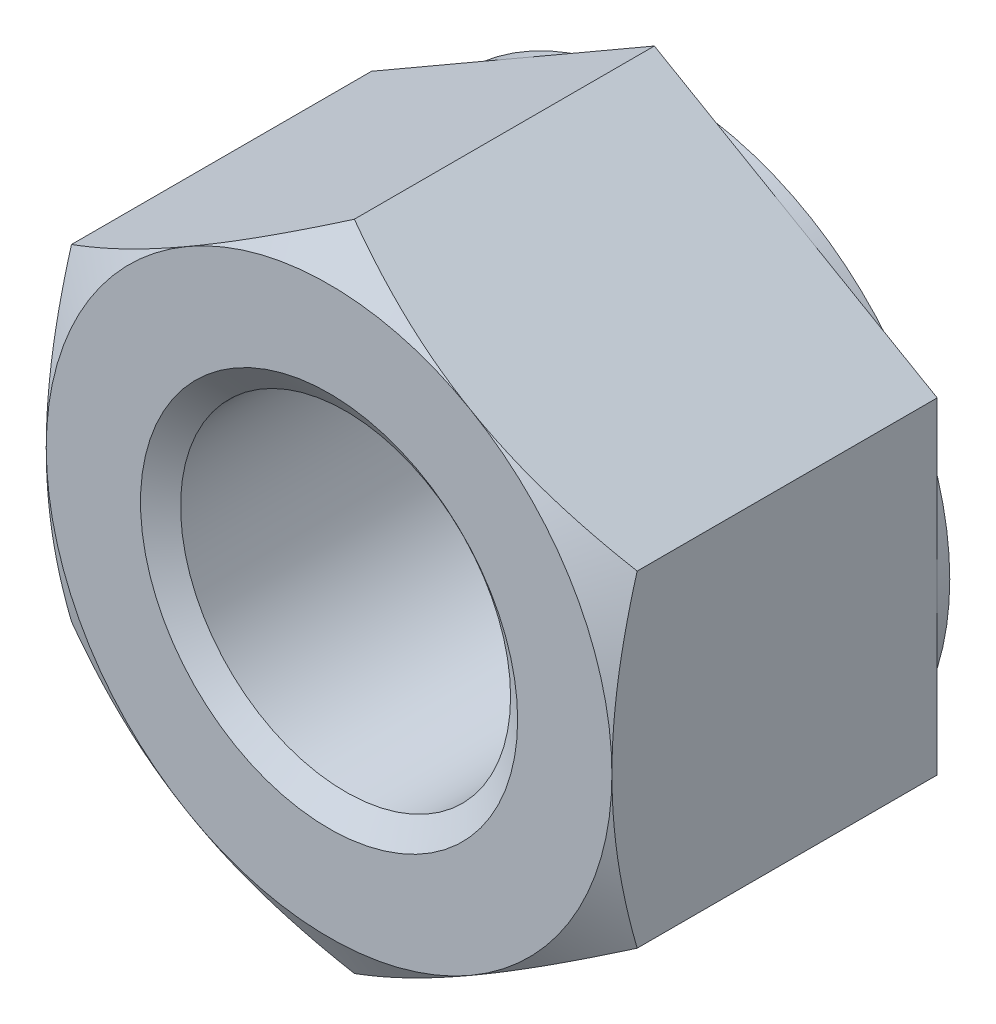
ISO-10303-21;
HEADER;
FILE_DESCRIPTION(('STEP AP214'),'2;1');
FILE_NAME('part.step','',(''),(''),'','','');
FILE_SCHEMA(('AUTOMOTIVE_DESIGN { 1 0 10303 214 1 1 1 1 }'));
ENDSEC;
DATA;
#1=APPLICATION_CONTEXT('core data for automotive mechanical design processes');
#2=APPLICATION_PROTOCOL_DEFINITION('international standard','automotive_design',2000,#1);
#3=PRODUCT_CONTEXT('',#1,'mechanical');
#4=PRODUCT('Part','Part','',(#3));
#5=PRODUCT_RELATED_PRODUCT_CATEGORY('part','',(#4));
#6=PRODUCT_DEFINITION_FORMATION('','',#4);
#7=PRODUCT_DEFINITION_CONTEXT('part definition',#1,'design');
#8=PRODUCT_DEFINITION('design','',#6,#7);
#9=PRODUCT_DEFINITION_SHAPE('','',#8);
#10=(LENGTH_UNIT() NAMED_UNIT(*) SI_UNIT(.MILLI.,.METRE.));
#11=(NAMED_UNIT(*) PLANE_ANGLE_UNIT() SI_UNIT($,.RADIAN.));
#12=(NAMED_UNIT(*) SI_UNIT($,.STERADIAN.) SOLID_ANGLE_UNIT());
#13=UNCERTAINTY_MEASURE_WITH_UNIT(LENGTH_MEASURE(1.E-05),#10,'distance_accuracy_value','');
#14=(GEOMETRIC_REPRESENTATION_CONTEXT(3) GLOBAL_UNCERTAINTY_ASSIGNED_CONTEXT((#13)) GLOBAL_UNIT_ASSIGNED_CONTEXT((#10,
#11,#12)) REPRESENTATION_CONTEXT('',''));
#15=CARTESIAN_POINT('',(0.,0.,0.));
#16=DIRECTION('',(0.,0.,1.));
#17=DIRECTION('',(1.,0.,0.));
#18=AXIS2_PLACEMENT_3D('',#15,#16,#17);
#19=CARTESIAN_POINT('',(0.,0.,-21.5));
#20=DIRECTION('',(0.,0.,1.));
#21=DIRECTION('',(1.,0.,0.));
#22=AXIS2_PLACEMENT_3D('',#19,#20,#21);
#23=CYLINDRICAL_SURFACE('',#22,10.5);
#24=CARTESIAN_POINT('',(0.,0.,-20.4496886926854));
#25=DIRECTION('',(0.,0.,1.));
#26=DIRECTION('',(1.,0.,0.));
#27=AXIS2_PLACEMENT_3D('',#24,#25,#26);
#28=CIRCLE('',#27,10.5);
#29=CARTESIAN_POINT('',(10.5,0.,-20.4496886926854));
#30=VERTEX_POINT('',#29);
#31=EDGE_CURVE('E482',#30,#30,#28,.T.);
#32=ORIENTED_EDGE('',*,*,#31,.F.);
#33=EDGE_LOOP('',(#32));
#34=FACE_BOUND('',#33,.T.);
#35=CARTESIAN_POINT('',(0.,0.,-1.05031130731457));
#36=DIRECTION('',(0.,0.,1.));
#37=DIRECTION('',(1.,0.,0.));
#38=AXIS2_PLACEMENT_3D('',#35,#36,#37);
#39=CIRCLE('',#38,10.5);
#40=CARTESIAN_POINT('',(10.5,0.,-1.05031130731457));
#41=VERTEX_POINT('',#40);
#42=EDGE_CURVE('E481',#41,#41,#39,.T.);
#43=ORIENTED_EDGE('',*,*,#42,.T.);
#44=EDGE_LOOP('',(#43));
#45=FACE_BOUND('',#44,.T.);
#46=ADVANCED_FACE('F33',(#34,#45),#23,.F.);
#47=CARTESIAN_POINT('',(0.,20.7846096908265,-21.5));
#48=DIRECTION('',(-0.500000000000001,0.866025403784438,0.));
#49=DIRECTION('',(-0.866025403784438,-0.500000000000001,0.));
#50=AXIS2_PLACEMENT_3D('',#47,#48,#49);
#51=PLANE('',#50);
#52=DIRECTION('',(0.,0.,1.));
#53=VECTOR('',#52,1.);
#54=CARTESIAN_POINT('',(-18.,10.3923048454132,-21.5));
#55=LINE('',#54,#53);
#56=CARTESIAN_POINT('',(-18.,10.3923048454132,-20.7));
#57=VERTEX_POINT('',#56);
#58=CARTESIAN_POINT('',(-18.,10.3923048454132,-1.60769515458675));
#59=VERTEX_POINT('',#58);
#60=EDGE_CURVE('E280',#57,#59,#55,.T.);
#61=ORIENTED_EDGE('',*,*,#60,.T.);
#62=CARTESIAN_POINT('',(-18.0002,10.3921893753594,-1.60776182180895));
#63=CARTESIAN_POINT('',(-17.6045674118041,10.6206079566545,-1.47589336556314));
#64=CARTESIAN_POINT('',(-17.2073916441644,10.8499174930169,-1.3500088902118));
#65=CARTESIAN_POINT('',(-16.4098552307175,11.310375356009,-1.11187123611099));
#66=CARTESIAN_POINT('',(-16.0094935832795,11.5415242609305,-0.999622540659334));
#67=CARTESIAN_POINT('',(-15.2048116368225,12.0061075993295,-0.790265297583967));
#68=CARTESIAN_POINT('',(-14.8004842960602,12.2395460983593,-0.693192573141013));
#69=CARTESIAN_POINT('',(-13.9890201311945,12.7080451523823,-0.516271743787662));
#70=CARTESIAN_POINT('',(-13.5818834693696,12.9431056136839,-0.43642265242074));
#71=CARTESIAN_POINT('',(-12.7752328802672,13.4088255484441,-0.297345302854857));
#72=CARTESIAN_POINT('',(-12.3757788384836,13.6394504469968,-0.237656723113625));
#73=CARTESIAN_POINT('',(-11.5750403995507,14.1017570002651,-0.137572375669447));
#74=CARTESIAN_POINT('',(-11.1737559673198,14.3334386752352,-0.0971769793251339));
#75=CARTESIAN_POINT('',(-10.370513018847,14.7971912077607,-0.0366989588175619));
#76=CARTESIAN_POINT('',(-9.96855587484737,15.0292612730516,-0.016592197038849));
#77=CARTESIAN_POINT('',(-9.16427056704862,15.4936156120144,0.00287614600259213));
#78=CARTESIAN_POINT('',(-8.76194241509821,15.7258998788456,0.00223836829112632));
#79=CARTESIAN_POINT('',(-8.00978065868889,16.1601606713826,-0.0183335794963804));
#80=CARTESIAN_POINT('',(-7.65989346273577,16.3621681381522,-0.0357591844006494));
#81=CARTESIAN_POINT('',(-6.96095368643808,16.765701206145,-0.0859690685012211));
#82=CARTESIAN_POINT('',(-6.61190109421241,16.9672268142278,-0.118753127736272));
#83=CARTESIAN_POINT('',(-5.91476277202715,17.3697198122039,-0.199111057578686));
#84=CARTESIAN_POINT('',(-5.56667820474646,17.5706865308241,-0.246698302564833));
#85=CARTESIAN_POINT('',(-4.87216610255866,17.9716632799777,-0.355822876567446));
#86=CARTESIAN_POINT('',(-4.5257385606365,18.1716733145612,-0.417360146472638));
#87=CARTESIAN_POINT('',(-3.47411308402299,18.7788295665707,-0.624462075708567));
#88=CARTESIAN_POINT('',(-2.77196054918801,19.1842175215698,-0.790677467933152));
#89=CARTESIAN_POINT('',(-1.37812528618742,19.9889486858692,-1.16791817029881));
#90=CARTESIAN_POINT('',(-0.686424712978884,20.3883021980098,-1.37885488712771));
#91=CARTESIAN_POINT('',(0.000199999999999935,20.7847251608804,-1.60776182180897));
#92=B_SPLINE_CURVE_WITH_KNOTS('',3,(#62,#63,#64,#65,#66,#67,#68,#69,#70,#71,#72,#73,#74,#75,#76,
#77,#78,#79,#80,#81,#82,#83,#84,#85,#86,#87,#88,#89,#90,#91),.UNSPECIFIED.,.F.,.F.,(4,2,2,2,2,2,
2,2,2,2,2,2,2,2,4),(0.,1.42650335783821,2.85347447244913,4.28376471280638,5.71397301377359,
7.10888071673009,8.50381526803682,9.89708828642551,11.2903182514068,12.5031974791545,
13.7160593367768,14.9300201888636,16.1439758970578,18.6253607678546,21.1018751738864),.UNSPECIFIED.);
#93=CARTESIAN_POINT('',(-9.00000000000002,15.5884572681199,0.));
#94=VERTEX_POINT('',#93);
#95=EDGE_CURVE('E134',#59,#94,#92,.T.);
#96=ORIENTED_EDGE('',*,*,#95,.T.);
#97=CARTESIAN_POINT('',(0.,20.7846096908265,-1.60769515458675));
#98=VERTEX_POINT('',#97);
#99=EDGE_CURVE('E161',#94,#98,#92,.T.);
#100=ORIENTED_EDGE('',*,*,#99,.T.);
#101=DIRECTION('',(0.,0.,1.));
#102=VECTOR('',#101,1.);
#103=CARTESIAN_POINT('',(0.,20.7846096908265,-21.5));
#104=LINE('',#103,#102);
#105=CARTESIAN_POINT('',(0.,20.7846096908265,-20.7));
#106=VERTEX_POINT('',#105);
#107=EDGE_CURVE('E268',#106,#98,#104,.T.);
#108=ORIENTED_EDGE('',*,*,#107,.F.);
#109=DIRECTION('',(-0.866025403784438,-0.500000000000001,0.));
#110=VECTOR('',#109,1.);
#111=CARTESIAN_POINT('',(0.,20.7846096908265,-20.7));
#112=LINE('',#111,#110);
#113=CARTESIAN_POINT('',(-9.00000000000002,15.5884572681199,-20.7));
#114=VERTEX_POINT('',#113);
#115=EDGE_CURVE('E256',#106,#114,#112,.T.);
#116=ORIENTED_EDGE('',*,*,#115,.T.);
#117=EDGE_CURVE('E252',#114,#57,#112,.T.);
#118=ORIENTED_EDGE('',*,*,#117,.T.);
#119=EDGE_LOOP('',(#61,#96,#100,#108,#116,#118));
#120=FACE_BOUND('',#119,.T.);
#121=ADVANCED_FACE('F35',(#120),#51,.T.);
#122=CARTESIAN_POINT('',(18.,10.3923048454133,-21.5));
#123=DIRECTION('',(0.500000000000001,0.866025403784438,0.));
#124=DIRECTION('',(-0.866025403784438,0.500000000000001,0.));
#125=AXIS2_PLACEMENT_3D('',#122,#123,#124);
#126=PLANE('',#125);
#127=ORIENTED_EDGE('',*,*,#107,.T.);
#128=CARTESIAN_POINT('',(-0.00020000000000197,20.7847251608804,-1.60776182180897));
#129=CARTESIAN_POINT('',(0.395432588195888,20.5563065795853,-1.47589336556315));
#130=CARTESIAN_POINT('',(0.79260835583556,20.3269970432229,-1.35000889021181));
#131=CARTESIAN_POINT('',(1.59014476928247,19.8665391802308,-1.111871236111));
#132=CARTESIAN_POINT('',(1.99050641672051,19.6353902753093,-0.999622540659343));
#133=CARTESIAN_POINT('',(2.79518836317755,19.1708069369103,-0.790265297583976));
#134=CARTESIAN_POINT('',(3.19951570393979,18.9373684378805,-0.693192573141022));
#135=CARTESIAN_POINT('',(4.01097986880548,18.4688693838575,-0.516271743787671));
#136=CARTESIAN_POINT('',(4.41811653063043,18.2338089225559,-0.436422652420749));
#137=CARTESIAN_POINT('',(5.22476711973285,17.7680889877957,-0.297345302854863));
#138=CARTESIAN_POINT('',(5.62422116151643,17.537464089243,-0.237656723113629));
#139=CARTESIAN_POINT('',(6.4249596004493,17.0751575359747,-0.137572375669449));
#140=CARTESIAN_POINT('',(6.82624403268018,16.8434758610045,-0.0971769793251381));
#141=CARTESIAN_POINT('',(7.62948698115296,16.3797233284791,-0.0366989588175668));
#142=CARTESIAN_POINT('',(8.03144412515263,16.1476532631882,-0.0165921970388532));
#143=CARTESIAN_POINT('',(8.83572943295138,15.6832989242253,0.00287614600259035));
#144=CARTESIAN_POINT('',(9.23805758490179,15.4510146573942,0.00223836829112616));
#145=CARTESIAN_POINT('',(9.99021934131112,15.0167538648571,-0.0183335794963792));
#146=CARTESIAN_POINT('',(10.3401065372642,14.8147463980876,-0.0357591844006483));
#147=CARTESIAN_POINT('',(11.0390463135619,14.4112133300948,-0.0859690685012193));
#148=CARTESIAN_POINT('',(11.3880989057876,14.209687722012,-0.11875312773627));
#149=CARTESIAN_POINT('',(12.0852372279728,13.8071947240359,-0.199111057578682));
#150=CARTESIAN_POINT('',(12.4333217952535,13.6062280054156,-0.246698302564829));
#151=CARTESIAN_POINT('',(13.1278338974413,13.2052512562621,-0.355822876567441));
#152=CARTESIAN_POINT('',(13.4742614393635,13.0052412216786,-0.417360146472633));
#153=CARTESIAN_POINT('',(14.525886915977,12.3980849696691,-0.62446207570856));
#154=CARTESIAN_POINT('',(15.228039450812,11.99269701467,-0.790677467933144));
#155=CARTESIAN_POINT('',(16.6218747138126,11.1879658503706,-1.1679181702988));
#156=CARTESIAN_POINT('',(17.3135752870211,10.78861233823,-1.3788548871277));
#157=CARTESIAN_POINT('',(18.0002,10.3921893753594,-1.60776182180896));
#158=B_SPLINE_CURVE_WITH_KNOTS('',3,(#128,#129,#130,#131,#132,#133,#134,#135,#136,#137,#138,
#139,#140,#141,#142,#143,#144,#145,#146,#147,#148,#149,#150,#151,#152,#153,#154,#155,#156,#157),
.UNSPECIFIED.,.F.,.F.,(4,2,2,2,2,2,2,2,2,2,2,2,2,2,4),(0.,1.42650335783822,2.85347447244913,
4.28376471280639,5.7139730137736,7.1088807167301,8.50381526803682,9.89708828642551,
11.2903182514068,12.5031974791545,13.7160593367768,14.9300201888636,16.1439758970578,
18.6253607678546,21.1018751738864),.UNSPECIFIED.);
#159=CARTESIAN_POINT('',(9.00000000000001,15.5884572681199,0.));
#160=VERTEX_POINT('',#159);
#161=EDGE_CURVE('E157',#98,#160,#158,.T.);
#162=ORIENTED_EDGE('',*,*,#161,.T.);
#163=CARTESIAN_POINT('',(18.,10.3923048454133,-1.60769515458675));
#164=VERTEX_POINT('',#163);
#165=EDGE_CURVE('E143',#160,#164,#158,.T.);
#166=ORIENTED_EDGE('',*,*,#165,.T.);
#167=DIRECTION('',(0.,0.,1.));
#168=VECTOR('',#167,1.);
#169=CARTESIAN_POINT('',(18.,10.3923048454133,-21.5));
#170=LINE('',#169,#168);
#171=CARTESIAN_POINT('',(18.,10.3923048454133,-20.7));
#172=VERTEX_POINT('',#171);
#173=EDGE_CURVE('E156',#172,#164,#170,.T.);
#174=ORIENTED_EDGE('',*,*,#173,.F.);
#175=DIRECTION('',(-0.866025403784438,0.500000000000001,0.));
#176=VECTOR('',#175,1.);
#177=CARTESIAN_POINT('',(18.,10.3923048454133,-20.7));
#178=LINE('',#177,#176);
#179=CARTESIAN_POINT('',(9.00000000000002,15.5884572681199,-20.7));
#180=VERTEX_POINT('',#179);
#181=EDGE_CURVE('E264',#172,#180,#178,.T.);
#182=ORIENTED_EDGE('',*,*,#181,.T.);
#183=EDGE_CURVE('E260',#180,#106,#178,.T.);
#184=ORIENTED_EDGE('',*,*,#183,.T.);
#185=EDGE_LOOP('',(#127,#162,#166,#174,#182,#184));
#186=FACE_BOUND('',#185,.T.);
#187=ADVANCED_FACE('F228',(#186),#126,.T.);
#188=CARTESIAN_POINT('',(18.,10.3923048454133,-21.5));
#189=DIRECTION('',(-1.,0.,0.));
#190=DIRECTION('',(0.,0.,1.));
#191=AXIS2_PLACEMENT_3D('',#188,#189,#190);
#192=PLANE('',#191);
#193=CARTESIAN_POINT('',(18.,-27.5619239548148,-8.61348069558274));
#194=CARTESIAN_POINT('',(18.,-27.1667877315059,-8.4224777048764));
#195=CARTESIAN_POINT('',(18.,-26.7711739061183,-8.23246323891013));
#196=CARTESIAN_POINT('',(18.,-25.978890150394,-7.85463825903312));
#197=CARTESIAN_POINT('',(18.,-25.5822202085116,-7.66682776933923));
#198=CARTESIAN_POINT('',(18.,-24.3903587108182,-7.10698821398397));
#199=CARTESIAN_POINT('',(18.,-23.5934439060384,-6.73861331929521));
#200=CARTESIAN_POINT('',(18.,-21.989547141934,-6.01187832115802));
#201=CARTESIAN_POINT('',(18.,-21.1825336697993,-5.65358759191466));
#202=CARTESIAN_POINT('',(18.,-19.5618746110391,-4.95238944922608));
#203=CARTESIAN_POINT('',(18.,-18.7482293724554,-4.60948123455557));
#204=CARTESIAN_POINT('',(18.,-17.1029123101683,-3.93907746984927));
#205=CARTESIAN_POINT('',(18.,-16.2711418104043,-3.61182282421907));
#206=CARTESIAN_POINT('',(18.,-14.597784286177,-2.98294292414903));
#207=CARTESIAN_POINT('',(18.,-13.7561961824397,-2.68132051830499));
#208=CARTESIAN_POINT('',(18.,-12.0636207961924,-2.11181367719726));
#209=CARTESIAN_POINT('',(18.,-11.2126578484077,-1.84385751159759));
#210=CARTESIAN_POINT('',(18.,-9.4985521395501,-1.3503722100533));
#211=CARTESIAN_POINT('',(18.,-8.63541331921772,-1.12482967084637));
#212=CARTESIAN_POINT('',(18.,-7.33140916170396,-0.826582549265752));
#213=CARTESIAN_POINT('',(18.,-6.89509921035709,-0.733829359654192));
#214=CARTESIAN_POINT('',(18.,-6.01957542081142,-0.563143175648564));
#215=CARTESIAN_POINT('',(18.,-5.5803616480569,-0.485209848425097));
#216=CARTESIAN_POINT('',(18.,-4.69932499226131,-0.345545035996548));
#217=CARTESIAN_POINT('',(18.,-4.25750195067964,-0.283814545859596));
#218=CARTESIAN_POINT('',(18.,-3.37175302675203,-0.177795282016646));
#219=CARTESIAN_POINT('',(18.,-2.92782714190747,-0.133506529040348));
#220=CARTESIAN_POINT('',(18.,-2.04133804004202,-0.0635630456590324));
#221=CARTESIAN_POINT('',(18.,-1.598784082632,-0.0377917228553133));
#222=CARTESIAN_POINT('',(18.,-0.712983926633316,-0.0050185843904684));
#223=CARTESIAN_POINT('',(18.,-0.26973773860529,0.00198351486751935));
#224=CARTESIAN_POINT('',(18.,0.616528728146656,-0.00294785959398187));
#225=CARTESIAN_POINT('',(18.,1.05954903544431,-0.0148760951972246));
#226=CARTESIAN_POINT('',(18.,1.94469673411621,-0.0573715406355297));
#227=CARTESIAN_POINT('',(18.,2.38682408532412,-0.0879395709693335));
#228=CARTESIAN_POINT('',(18.,3.45808110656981,-0.183949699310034));
#229=CARTESIAN_POINT('',(18.,4.08639173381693,-0.258712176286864));
#230=CARTESIAN_POINT('',(18.,5.3380908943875,-0.441718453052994));
#231=CARTESIAN_POINT('',(18.,5.96147868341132,-0.549967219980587));
#232=CARTESIAN_POINT('',(18.,7.82534534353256,-0.919513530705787));
#233=CARTESIAN_POINT('',(18.,9.05709271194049,-1.22536507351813));
#234=CARTESIAN_POINT('',(18.,10.8995809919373,-1.75275444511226));
#235=CARTESIAN_POINT('',(18.,11.5199484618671,-1.94256699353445));
#236=CARTESIAN_POINT('',(18.,12.7546900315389,-2.3411171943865));
#237=CARTESIAN_POINT('',(18.,13.3690635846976,-2.5498565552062));
#238=CARTESIAN_POINT('',(18.,14.5887549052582,-2.98181266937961));
#239=CARTESIAN_POINT('',(18.,15.1941042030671,-3.20494114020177));
#240=CARTESIAN_POINT('',(18.,16.0983156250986,-3.54929436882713));
#241=CARTESIAN_POINT('',(18.,16.3990354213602,-3.66566915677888));
#242=CARTESIAN_POINT('',(18.,16.999306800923,-3.90137756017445));
#243=CARTESIAN_POINT('',(18.,17.2988584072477,-4.02071111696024));
#244=CARTESIAN_POINT('',(18.,17.5978664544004,-4.14139052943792));
#245=B_SPLINE_CURVE_WITH_KNOTS('',3,(#193,#194,#195,#196,#197,#198,#199,#200,#201,#202,#203,
#204,#205,#206,#207,#208,#209,#210,#211,#212,#213,#214,#215,#216,#217,#218,#219,#220,#221,#222,
#223,#224,#225,#226,#227,#228,#229,#230,#231,#232,#233,#234,#235,#236,#237,#238,#239,#240,#241,
#242,#243,#244),.UNSPECIFIED.,.F.,.F.,(4,2,2,2,2,2,2,2,2,2,2,2,2,2,2,2,2,2,2,2,2,2,2,2,2,4),(0.,
1.3166344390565,2.6332833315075,5.2670092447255,7.91580691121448,10.5644664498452,
13.2456434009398,15.9271179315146,18.6027786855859,21.2775924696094,22.6155612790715,
23.9535000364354,25.2915209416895,26.6295434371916,27.9590656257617,29.2885677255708,
30.6177020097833,31.9468948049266,33.8440459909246,35.7414787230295,39.5436531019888,
41.4897689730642,43.436060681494,45.3713764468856,46.338719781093,47.3060439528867),.UNSPECIFIED.);
#246=CARTESIAN_POINT('',(18.,-10.3923048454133,-1.60769515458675));
#247=VERTEX_POINT('',#246);
#248=CARTESIAN_POINT('',(18.,0.,0.));
#249=VERTEX_POINT('',#248);
#250=EDGE_CURVE('E123',#247,#249,#245,.T.);
#251=ORIENTED_EDGE('',*,*,#250,.F.);
#252=DIRECTION('',(0.,0.,1.));
#253=VECTOR('',#252,1.);
#254=CARTESIAN_POINT('',(18.,-10.3923048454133,-21.5));
#255=LINE('',#254,#253);
#256=CARTESIAN_POINT('',(18.,-10.3923048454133,-20.7));
#257=VERTEX_POINT('',#256);
#258=EDGE_CURVE('E273',#257,#247,#255,.T.);
#259=ORIENTED_EDGE('',*,*,#258,.F.);
#260=DIRECTION('',(0.,-1.,0.));
#261=VECTOR('',#260,1.);
#262=CARTESIAN_POINT('',(18.,10.3923048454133,-20.7));
#263=LINE('',#262,#261);
#264=CARTESIAN_POINT('',(18.,0.,-20.7));
#265=VERTEX_POINT('',#264);
#266=EDGE_CURVE('E265',#265,#257,#263,.T.);
#267=ORIENTED_EDGE('',*,*,#266,.F.);
#268=EDGE_CURVE('E267',#172,#265,#263,.T.);
#269=ORIENTED_EDGE('',*,*,#268,.F.);
#270=ORIENTED_EDGE('',*,*,#173,.T.);
#271=EDGE_CURVE('E136',#249,#164,#245,.T.);
#272=ORIENTED_EDGE('',*,*,#271,.F.);
#273=EDGE_LOOP('',(#251,#259,#267,#269,#270,#272));
#274=FACE_BOUND('',#273,.T.);
#275=ADVANCED_FACE('F153',(#274),#192,.F.);
#276=CARTESIAN_POINT('',(0.,-20.7846096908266,-21.5));
#277=DIRECTION('',(0.500000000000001,-0.866025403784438,0.));
#278=DIRECTION('',(0.866025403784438,0.500000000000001,0.));
#279=AXIS2_PLACEMENT_3D('',#276,#277,#278);
#280=PLANE('',#279);
#281=ORIENTED_EDGE('',*,*,#258,.T.);
#282=CARTESIAN_POINT('',(18.0002,-10.3921893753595,-1.60776182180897));
#283=CARTESIAN_POINT('',(17.6045674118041,-10.6206079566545,-1.47589336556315));
#284=CARTESIAN_POINT('',(17.2073916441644,-10.8499174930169,-1.35000889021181));
#285=CARTESIAN_POINT('',(16.4098552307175,-11.310375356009,-1.111871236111));
#286=CARTESIAN_POINT('',(16.0094935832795,-11.5415242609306,-0.999622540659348));
#287=CARTESIAN_POINT('',(15.2048116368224,-12.0061075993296,-0.790265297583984));
#288=CARTESIAN_POINT('',(14.8004842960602,-12.2395460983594,-0.693192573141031));
#289=CARTESIAN_POINT('',(13.9890201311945,-12.7080451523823,-0.516271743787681));
#290=CARTESIAN_POINT('',(13.5818834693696,-12.9431056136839,-0.436422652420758));
#291=CARTESIAN_POINT('',(12.7752328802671,-13.4088255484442,-0.297345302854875));
#292=CARTESIAN_POINT('',(12.3757788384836,-13.6394504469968,-0.237656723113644));
#293=CARTESIAN_POINT('',(11.5750403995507,-14.1017570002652,-0.137572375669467));
#294=CARTESIAN_POINT('',(11.1737559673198,-14.3334386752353,-0.0971769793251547));
#295=CARTESIAN_POINT('',(10.370513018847,-14.7971912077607,-0.0366989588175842));
#296=CARTESIAN_POINT('',(9.96855587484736,-15.0292612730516,-0.0165921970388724));
#297=CARTESIAN_POINT('',(9.16427056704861,-15.4936156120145,0.00287614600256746));
#298=CARTESIAN_POINT('',(8.7619424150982,-15.7258998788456,0.00223836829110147));
#299=CARTESIAN_POINT('',(8.00978065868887,-16.1601606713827,-0.0183335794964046));
#300=CARTESIAN_POINT('',(7.65989346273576,-16.3621681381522,-0.035759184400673));
#301=CARTESIAN_POINT('',(6.96095368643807,-16.765701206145,-0.085969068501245));
#302=CARTESIAN_POINT('',(6.6119010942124,-16.9672268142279,-0.118753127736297));
#303=CARTESIAN_POINT('',(5.91476277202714,-17.3697198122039,-0.199111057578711));
#304=CARTESIAN_POINT('',(5.56667820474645,-17.5706865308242,-0.246698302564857));
#305=CARTESIAN_POINT('',(4.87216610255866,-17.9716632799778,-0.355822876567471));
#306=CARTESIAN_POINT('',(4.5257385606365,-18.1716733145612,-0.417360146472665));
#307=CARTESIAN_POINT('',(3.47411308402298,-18.7788295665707,-0.624462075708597));
#308=CARTESIAN_POINT('',(2.77196054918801,-19.1842175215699,-0.790677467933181));
#309=CARTESIAN_POINT('',(1.37812528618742,-19.9889486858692,-1.16791817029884));
#310=CARTESIAN_POINT('',(0.686424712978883,-20.3883021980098,-1.37885488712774));
#311=CARTESIAN_POINT('',(-0.000199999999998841,-20.7847251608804,-1.607761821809));
#312=B_SPLINE_CURVE_WITH_KNOTS('',3,(#282,#283,#284,#285,#286,#287,#288,#289,#290,#291,#292,
#293,#294,#295,#296,#297,#298,#299,#300,#301,#302,#303,#304,#305,#306,#307,#308,#309,#310,#311),
.UNSPECIFIED.,.F.,.F.,(4,2,2,2,2,2,2,2,2,2,2,2,2,2,4),(0.,1.42650335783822,2.85347447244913,
4.28376471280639,5.7139730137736,7.1088807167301,8.50381526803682,9.89708828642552,
11.2903182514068,12.5031974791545,13.7160593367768,14.9300201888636,16.1439758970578,
18.6253607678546,21.1018751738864),.UNSPECIFIED.);
#313=CARTESIAN_POINT('',(9.00000000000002,-15.5884572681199,0.));
#314=VERTEX_POINT('',#313);
#315=EDGE_CURVE('E129',#247,#314,#312,.T.);
#316=ORIENTED_EDGE('',*,*,#315,.T.);
#317=CARTESIAN_POINT('',(0.,-20.7846096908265,-1.60769515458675));
#318=VERTEX_POINT('',#317);
#319=EDGE_CURVE('E50',#314,#318,#312,.T.);
#320=ORIENTED_EDGE('',*,*,#319,.T.);
#321=DIRECTION('',(0.,0.,1.));
#322=VECTOR('',#321,1.);
#323=CARTESIAN_POINT('',(0.,-20.7846096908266,-21.5));
#324=LINE('',#323,#322);
#325=CARTESIAN_POINT('',(0.,-20.7846096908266,-20.7));
#326=VERTEX_POINT('',#325);
#327=EDGE_CURVE('E275',#326,#318,#324,.T.);
#328=ORIENTED_EDGE('',*,*,#327,.F.);
#329=DIRECTION('',(0.866025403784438,0.500000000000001,0.));
#330=VECTOR('',#329,1.);
#331=CARTESIAN_POINT('',(0.,-20.7846096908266,-20.7));
#332=LINE('',#331,#330);
#333=CARTESIAN_POINT('',(9.00000000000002,-15.5884572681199,-20.7));
#334=VERTEX_POINT('',#333);
#335=EDGE_CURVE('E257',#326,#334,#332,.T.);
#336=ORIENTED_EDGE('',*,*,#335,.T.);
#337=EDGE_CURVE('E261',#334,#257,#332,.T.);
#338=ORIENTED_EDGE('',*,*,#337,.T.);
#339=EDGE_LOOP('',(#281,#316,#320,#328,#336,#338));
#340=FACE_BOUND('',#339,.T.);
#341=ADVANCED_FACE('F209',(#340),#280,.T.);
#342=CARTESIAN_POINT('',(-18.,-10.3923048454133,-21.5));
#343=DIRECTION('',(-0.500000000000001,-0.866025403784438,0.));
#344=DIRECTION('',(0.866025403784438,-0.500000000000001,0.));
#345=AXIS2_PLACEMENT_3D('',#342,#343,#344);
#346=PLANE('',#345);
#347=ORIENTED_EDGE('',*,*,#327,.T.);
#348=CARTESIAN_POINT('',(0.000200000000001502,-20.7847251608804,-1.607761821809));
#349=CARTESIAN_POINT('',(-0.395432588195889,-20.5563065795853,-1.47589336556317));
#350=CARTESIAN_POINT('',(-0.792608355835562,-20.326997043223,-1.35000889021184));
#351=CARTESIAN_POINT('',(-1.59014476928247,-19.8665391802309,-1.11187123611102));
#352=CARTESIAN_POINT('',(-1.99050641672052,-19.6353902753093,-0.999622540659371));
#353=CARTESIAN_POINT('',(-2.79518836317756,-19.1708069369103,-0.790265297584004));
#354=CARTESIAN_POINT('',(-3.1995157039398,-18.9373684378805,-0.69319257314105));
#355=CARTESIAN_POINT('',(-4.01097986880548,-18.4688693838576,-0.516271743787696));
#356=CARTESIAN_POINT('',(-4.41811653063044,-18.233808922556,-0.436422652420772));
#357=CARTESIAN_POINT('',(-5.22476711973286,-17.7680889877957,-0.297345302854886));
#358=CARTESIAN_POINT('',(-5.62422116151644,-17.5374640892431,-0.237656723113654));
#359=CARTESIAN_POINT('',(-6.42495960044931,-17.0751575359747,-0.137572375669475));
#360=CARTESIAN_POINT('',(-6.8262440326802,-16.8434758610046,-0.0971769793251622));
#361=CARTESIAN_POINT('',(-7.62948698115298,-16.3797233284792,-0.0366989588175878));
#362=CARTESIAN_POINT('',(-8.03144412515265,-16.1476532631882,-0.0165921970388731));
#363=CARTESIAN_POINT('',(-8.8357294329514,-15.6832989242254,0.00287614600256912));
#364=CARTESIAN_POINT('',(-9.23805758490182,-15.4510146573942,0.00223836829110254));
#365=CARTESIAN_POINT('',(-9.99021934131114,-15.0167538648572,-0.0183335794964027));
#366=CARTESIAN_POINT('',(-10.3401065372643,-14.8147463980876,-0.0357591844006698));
#367=CARTESIAN_POINT('',(-11.0390463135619,-14.4112133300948,-0.0859690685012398));
#368=CARTESIAN_POINT('',(-11.3880989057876,-14.209687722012,-0.118753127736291));
#369=CARTESIAN_POINT('',(-12.0852372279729,-13.8071947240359,-0.199111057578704));
#370=CARTESIAN_POINT('',(-12.4333217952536,-13.6062280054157,-0.24669830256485));
#371=CARTESIAN_POINT('',(-13.1278338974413,-13.2052512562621,-0.355822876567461));
#372=CARTESIAN_POINT('',(-13.4742614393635,-13.0052412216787,-0.417360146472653));
#373=CARTESIAN_POINT('',(-14.525886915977,-12.3980849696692,-0.62446207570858));
#374=CARTESIAN_POINT('',(-15.228039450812,-11.99269701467,-0.790677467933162));
#375=CARTESIAN_POINT('',(-16.6218747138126,-11.1879658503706,-1.16791817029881));
#376=CARTESIAN_POINT('',(-17.3135752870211,-10.7886123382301,-1.37885488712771));
#377=CARTESIAN_POINT('',(-18.0002,-10.3921893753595,-1.60776182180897));
#378=B_SPLINE_CURVE_WITH_KNOTS('',3,(#348,#349,#350,#351,#352,#353,#354,#355,#356,#357,#358,
#359,#360,#361,#362,#363,#364,#365,#366,#367,#368,#369,#370,#371,#372,#373,#374,#375,#376,#377),
.UNSPECIFIED.,.F.,.F.,(4,2,2,2,2,2,2,2,2,2,2,2,2,2,4),(0.,1.42650335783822,2.85347447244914,
4.2837647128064,5.71397301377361,7.10888071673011,8.50381526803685,9.89708828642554,
11.2903182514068,12.5031974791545,13.7160593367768,14.9300201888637,16.1439758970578,
18.6253607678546,21.1018751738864),.UNSPECIFIED.);
#379=CARTESIAN_POINT('',(-9.00000000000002,-15.5884572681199,0.));
#380=VERTEX_POINT('',#379);
#381=EDGE_CURVE('E203',#318,#380,#378,.T.);
#382=ORIENTED_EDGE('',*,*,#381,.T.);
#383=CARTESIAN_POINT('',(-18.,-10.3923048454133,-1.60769515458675));
#384=VERTEX_POINT('',#383);
#385=EDGE_CURVE('E57',#380,#384,#378,.T.);
#386=ORIENTED_EDGE('',*,*,#385,.T.);
#387=DIRECTION('',(0.,0.,1.));
#388=VECTOR('',#387,1.);
#389=CARTESIAN_POINT('',(-18.,-10.3923048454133,-21.5));
#390=LINE('',#389,#388);
#391=CARTESIAN_POINT('',(-18.,-10.3923048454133,-20.7));
#392=VERTEX_POINT('',#391);
#393=EDGE_CURVE('E278',#392,#384,#390,.T.);
#394=ORIENTED_EDGE('',*,*,#393,.F.);
#395=DIRECTION('',(0.866025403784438,-0.500000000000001,0.));
#396=VECTOR('',#395,1.);
#397=CARTESIAN_POINT('',(-18.,-10.3923048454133,-20.7));
#398=LINE('',#397,#396);
#399=CARTESIAN_POINT('',(-9.00000000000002,-15.5884572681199,-20.7));
#400=VERTEX_POINT('',#399);
#401=EDGE_CURVE('E247',#392,#400,#398,.T.);
#402=ORIENTED_EDGE('',*,*,#401,.T.);
#403=EDGE_CURVE('E253',#400,#326,#398,.T.);
#404=ORIENTED_EDGE('',*,*,#403,.T.);
#405=EDGE_LOOP('',(#347,#382,#386,#394,#402,#404));
#406=FACE_BOUND('',#405,.T.);
#407=ADVANCED_FACE('F205',(#406),#346,.T.);
#408=CARTESIAN_POINT('',(-18.,10.3923048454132,-21.5));
#409=DIRECTION('',(-1.,0.,0.));
#410=DIRECTION('',(0.,0.,1.));
#411=AXIS2_PLACEMENT_3D('',#408,#409,#410);
#412=PLANE('',#411);
#413=ORIENTED_EDGE('',*,*,#393,.T.);
#414=CARTESIAN_POINT('',(-18.,-27.5619239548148,-8.61348069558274));
#415=CARTESIAN_POINT('',(-18.,-27.1667877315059,-8.42247770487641));
#416=CARTESIAN_POINT('',(-18.,-26.7711739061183,-8.23246323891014));
#417=CARTESIAN_POINT('',(-18.,-25.978890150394,-7.85463825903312));
#418=CARTESIAN_POINT('',(-18.,-25.5822202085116,-7.66682776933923));
#419=CARTESIAN_POINT('',(-18.,-24.3903587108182,-7.10698821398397));
#420=CARTESIAN_POINT('',(-18.,-23.5934439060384,-6.73861331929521));
#421=CARTESIAN_POINT('',(-18.,-21.989547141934,-6.01187832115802));
#422=CARTESIAN_POINT('',(-18.,-21.1825336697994,-5.65358759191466));
#423=CARTESIAN_POINT('',(-18.,-19.5618746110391,-4.95238944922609));
#424=CARTESIAN_POINT('',(-18.,-18.7482293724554,-4.60948123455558));
#425=CARTESIAN_POINT('',(-18.,-17.1029123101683,-3.93907746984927));
#426=CARTESIAN_POINT('',(-18.,-16.2711418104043,-3.61182282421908));
#427=CARTESIAN_POINT('',(-18.,-14.597784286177,-2.98294292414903));
#428=CARTESIAN_POINT('',(-18.,-13.7561961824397,-2.68132051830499));
#429=CARTESIAN_POINT('',(-18.,-12.0636207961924,-2.11181367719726));
#430=CARTESIAN_POINT('',(-18.,-11.2126578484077,-1.8438575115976));
#431=CARTESIAN_POINT('',(-18.,-9.49855213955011,-1.3503722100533));
#432=CARTESIAN_POINT('',(-18.,-8.63541331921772,-1.12482967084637));
#433=CARTESIAN_POINT('',(-18.,-7.33140916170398,-0.826582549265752));
#434=CARTESIAN_POINT('',(-18.,-6.8950992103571,-0.733829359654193));
#435=CARTESIAN_POINT('',(-18.,-6.01957542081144,-0.563143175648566));
#436=CARTESIAN_POINT('',(-18.,-5.58036164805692,-0.4852098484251));
#437=CARTESIAN_POINT('',(-18.,-4.69932499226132,-0.345545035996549));
#438=CARTESIAN_POINT('',(-18.,-4.25750195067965,-0.283814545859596));
#439=CARTESIAN_POINT('',(-18.,-3.37175302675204,-0.177795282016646));
#440=CARTESIAN_POINT('',(-18.,-2.92782714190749,-0.133506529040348));
#441=CARTESIAN_POINT('',(-18.,-2.04133804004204,-0.0635630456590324));
#442=CARTESIAN_POINT('',(-18.,-1.59878408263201,-0.0377917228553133));
#443=CARTESIAN_POINT('',(-18.,-0.71298392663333,-0.00501858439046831));
#444=CARTESIAN_POINT('',(-18.,-0.269737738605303,0.0019835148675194));
#445=CARTESIAN_POINT('',(-18.,0.616528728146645,-0.00294785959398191));
#446=CARTESIAN_POINT('',(-18.,1.0595490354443,-0.0148760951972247));
#447=CARTESIAN_POINT('',(-18.,1.9446967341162,-0.0573715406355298));
#448=CARTESIAN_POINT('',(-18.,2.38682408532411,-0.0879395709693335));
#449=CARTESIAN_POINT('',(-18.,3.45808110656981,-0.183949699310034));
#450=CARTESIAN_POINT('',(-18.,4.08639173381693,-0.258712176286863));
#451=CARTESIAN_POINT('',(-18.,5.3380908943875,-0.441718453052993));
#452=CARTESIAN_POINT('',(-18.,5.96147868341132,-0.549967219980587));
#453=CARTESIAN_POINT('',(-18.,7.82534534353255,-0.919513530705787));
#454=CARTESIAN_POINT('',(-18.,9.05709271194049,-1.22536507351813));
#455=CARTESIAN_POINT('',(-18.,10.8995809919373,-1.75275444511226));
#456=CARTESIAN_POINT('',(-18.,11.5199484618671,-1.94256699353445));
#457=CARTESIAN_POINT('',(-18.,12.7546900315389,-2.3411171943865));
#458=CARTESIAN_POINT('',(-18.,13.3690635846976,-2.5498565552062));
#459=CARTESIAN_POINT('',(-18.,14.5887549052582,-2.98181266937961));
#460=CARTESIAN_POINT('',(-18.,15.1941042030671,-3.20494114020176));
#461=CARTESIAN_POINT('',(-18.,16.0983156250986,-3.54929436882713));
#462=CARTESIAN_POINT('',(-18.,16.3990354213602,-3.66566915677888));
#463=CARTESIAN_POINT('',(-18.,16.999306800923,-3.90137756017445));
#464=CARTESIAN_POINT('',(-18.,17.2988584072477,-4.02071111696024));
#465=CARTESIAN_POINT('',(-18.,17.5978664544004,-4.14139052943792));
#466=B_SPLINE_CURVE_WITH_KNOTS('',3,(#414,#415,#416,#417,#418,#419,#420,#421,#422,#423,#424,
#425,#426,#427,#428,#429,#430,#431,#432,#433,#434,#435,#436,#437,#438,#439,#440,#441,#442,#443,
#444,#445,#446,#447,#448,#449,#450,#451,#452,#453,#454,#455,#456,#457,#458,#459,#460,#461,#462,
#463,#464,#465),.UNSPECIFIED.,.F.,.F.,(4,2,2,2,2,2,2,2,2,2,2,2,2,2,2,2,2,2,2,2,2,2,2,2,2,4),(0.,
1.3166344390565,2.6332833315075,5.2670092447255,7.91580691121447,10.5644664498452,
13.2456434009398,15.9271179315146,18.6027786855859,21.2775924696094,22.6155612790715,
23.9535000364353,25.2915209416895,26.6295434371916,27.9590656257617,29.2885677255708,
30.6177020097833,31.9468948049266,33.8440459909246,35.7414787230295,39.5436531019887,
41.4897689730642,43.436060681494,45.3713764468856,46.338719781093,47.3060439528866),.UNSPECIFIED.);
#467=CARTESIAN_POINT('',(-18.,0.,0.));
#468=VERTEX_POINT('',#467);
#469=EDGE_CURVE('E204',#384,#468,#466,.T.);
#470=ORIENTED_EDGE('',*,*,#469,.T.);
#471=EDGE_CURVE('E147',#468,#59,#466,.T.);
#472=ORIENTED_EDGE('',*,*,#471,.T.);
#473=ORIENTED_EDGE('',*,*,#60,.F.);
#474=DIRECTION('',(0.,-1.,0.));
#475=VECTOR('',#474,1.);
#476=CARTESIAN_POINT('',(-18.,10.3923048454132,-20.7));
#477=LINE('',#476,#475);
#478=CARTESIAN_POINT('',(-18.,0.,-20.7));
#479=VERTEX_POINT('',#478);
#480=EDGE_CURVE('E286',#57,#479,#477,.T.);
#481=ORIENTED_EDGE('',*,*,#480,.T.);
#482=EDGE_CURVE('E284',#479,#392,#477,.T.);
#483=ORIENTED_EDGE('',*,*,#482,.T.);
#484=EDGE_LOOP('',(#413,#470,#472,#473,#481,#483));
#485=FACE_BOUND('',#484,.T.);
#486=ADVANCED_FACE('F208',(#485),#412,.T.);
#487=CARTESIAN_POINT('',(-36.,0.,0.));
#488=DIRECTION('',(0.,0.,1.));
#489=DIRECTION('',(1.,0.,0.));
#490=AXIS2_PLACEMENT_3D('',#487,#488,#489);
#491=PLANE('',#490);
#492=CARTESIAN_POINT('',(0.,0.,0.));
#493=DIRECTION('',(0.,0.,1.));
#494=DIRECTION('',(1.,0.,0.));
#495=AXIS2_PLACEMENT_3D('',#492,#493,#494);
#496=CIRCLE('',#495,12.);
#497=CARTESIAN_POINT('',(12.,0.,0.));
#498=VERTEX_POINT('',#497);
#499=EDGE_CURVE('E478',#498,#498,#496,.T.);
#500=ORIENTED_EDGE('',*,*,#499,.F.);
#501=EDGE_LOOP('',(#500));
#502=FACE_BOUND('',#501,.T.);
#503=CARTESIAN_POINT('',(0.,0.,0.));
#504=DIRECTION('',(0.,0.,1.));
#505=DIRECTION('',(1.,0.,0.));
#506=AXIS2_PLACEMENT_3D('',#503,#504,#505);
#507=CIRCLE('',#506,18.);
#508=EDGE_CURVE('E12',#249,#314,#507,.F.);
#509=ORIENTED_EDGE('',*,*,#508,.F.);
#510=CARTESIAN_POINT('',(0.,0.,0.));
#511=DIRECTION('',(0.,0.,1.));
#512=DIRECTION('',(1.,0.,0.));
#513=AXIS2_PLACEMENT_3D('',#510,#511,#512);
#514=CIRCLE('',#513,18.);
#515=EDGE_CURVE('E140',#249,#160,#514,.T.);
#516=ORIENTED_EDGE('',*,*,#515,.T.);
#517=EDGE_CURVE('E43',#94,#160,#507,.F.);
#518=ORIENTED_EDGE('',*,*,#517,.F.);
#519=EDGE_CURVE('E290',#468,#94,#507,.F.);
#520=ORIENTED_EDGE('',*,*,#519,.F.);
#521=EDGE_CURVE('E293',#380,#468,#507,.F.);
#522=ORIENTED_EDGE('',*,*,#521,.F.);
#523=EDGE_CURVE('E42',#314,#380,#507,.F.);
#524=ORIENTED_EDGE('',*,*,#523,.F.);
#525=EDGE_LOOP('',(#509,#516,#518,#520,#522,#524));
#526=FACE_BOUND('',#525,.T.);
#527=ADVANCED_FACE('F150',(#502,#526),#491,.T.);
#528=CARTESIAN_POINT('',(-36.,0.,-21.5));
#529=DIRECTION('',(0.,0.,1.));
#530=DIRECTION('',(1.,0.,0.));
#531=AXIS2_PLACEMENT_3D('',#528,#529,#530);
#532=PLANE('',#531);
#533=CARTESIAN_POINT('',(0.,0.,-21.5));
#534=DIRECTION('',(0.,0.,1.));
#535=DIRECTION('',(1.,0.,0.));
#536=AXIS2_PLACEMENT_3D('',#533,#534,#535);
#537=CIRCLE('',#536,12.);
#538=CARTESIAN_POINT('',(12.,0.,-21.5));
#539=VERTEX_POINT('',#538);
#540=EDGE_CURVE('E148',#539,#539,#537,.T.);
#541=ORIENTED_EDGE('',*,*,#540,.T.);
#542=EDGE_LOOP('',(#541));
#543=FACE_BOUND('',#542,.T.);
#544=CARTESIAN_POINT('',(0.,0.,-21.5));
#545=DIRECTION('',(0.,0.,1.));
#546=DIRECTION('',(1.,0.,0.));
#547=AXIS2_PLACEMENT_3D('',#544,#545,#546);
#548=CIRCLE('',#547,18.);
#549=CARTESIAN_POINT('',(18.,0.,-21.5));
#550=VERTEX_POINT('',#549);
#551=EDGE_CURVE('E271',#550,#550,#548,.F.);
#552=ORIENTED_EDGE('',*,*,#551,.T.);
#553=EDGE_LOOP('',(#552));
#554=FACE_BOUND('',#553,.T.);
#555=ADVANCED_FACE('F218',(#543,#554),#532,.F.);
#556=CARTESIAN_POINT('',(0.,30.7846096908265,-20.7));
#557=DIRECTION('',(0.,0.,-1.));
#558=DIRECTION('',(-1.,0.,0.));
#559=AXIS2_PLACEMENT_3D('',#556,#557,#558);
#560=PLANE('',#559);
#561=ORIENTED_EDGE('',*,*,#268,.T.);
#562=CARTESIAN_POINT('',(0.,0.,-20.7));
#563=DIRECTION('',(0.,0.,1.));
#564=DIRECTION('',(1.,0.,0.));
#565=AXIS2_PLACEMENT_3D('',#562,#563,#564);
#566=CIRCLE('',#565,18.);
#567=EDGE_CURVE('E244',#265,#180,#566,.T.);
#568=ORIENTED_EDGE('',*,*,#567,.T.);
#569=ORIENTED_EDGE('',*,*,#181,.F.);
#570=EDGE_LOOP('',(#561,#568,#569));
#571=FACE_BOUND('',#570,.T.);
#572=ADVANCED_FACE('F235',(#571),#560,.T.);
#573=ORIENTED_EDGE('',*,*,#266,.T.);
#574=ORIENTED_EDGE('',*,*,#337,.F.);
#575=EDGE_CURVE('E249',#334,#265,#566,.T.);
#576=ORIENTED_EDGE('',*,*,#575,.T.);
#577=EDGE_LOOP('',(#573,#574,#576));
#578=FACE_BOUND('',#577,.T.);
#579=ADVANCED_FACE('F305',(#578),#560,.T.);
#580=EDGE_CURVE('E248',#180,#114,#566,.T.);
#581=ORIENTED_EDGE('',*,*,#580,.T.);
#582=ORIENTED_EDGE('',*,*,#115,.F.);
#583=ORIENTED_EDGE('',*,*,#183,.F.);
#584=EDGE_LOOP('',(#581,#582,#583));
#585=FACE_BOUND('',#584,.T.);
#586=ADVANCED_FACE('F387',(#585),#560,.T.);
#587=ORIENTED_EDGE('',*,*,#403,.F.);
#588=EDGE_CURVE('E311',#400,#334,#566,.T.);
#589=ORIENTED_EDGE('',*,*,#588,.T.);
#590=ORIENTED_EDGE('',*,*,#335,.F.);
#591=EDGE_LOOP('',(#587,#589,#590));
#592=FACE_BOUND('',#591,.T.);
#593=ADVANCED_FACE('F378',(#592),#560,.T.);
#594=EDGE_CURVE('E505',#114,#479,#566,.T.);
#595=ORIENTED_EDGE('',*,*,#594,.T.);
#596=ORIENTED_EDGE('',*,*,#480,.F.);
#597=ORIENTED_EDGE('',*,*,#117,.F.);
#598=EDGE_LOOP('',(#595,#596,#597));
#599=FACE_BOUND('',#598,.T.);
#600=ADVANCED_FACE('F329',(#599),#560,.T.);
#601=CARTESIAN_POINT('',(0.,0.,0.));
#602=DIRECTION('',(0.,0.,1.));
#603=DIRECTION('',(1.,0.,0.));
#604=AXIS2_PLACEMENT_3D('',#601,#602,#603);
#605=CYLINDRICAL_SURFACE('',#604,18.);
#606=ORIENTED_EDGE('',*,*,#551,.F.);
#607=EDGE_LOOP('',(#606));
#608=FACE_BOUND('',#607,.T.);
#609=ORIENTED_EDGE('',*,*,#580,.F.);
#610=ORIENTED_EDGE('',*,*,#567,.F.);
#611=ORIENTED_EDGE('',*,*,#575,.F.);
#612=ORIENTED_EDGE('',*,*,#588,.F.);
#613=EDGE_CURVE('E508',#479,#400,#566,.T.);
#614=ORIENTED_EDGE('',*,*,#613,.F.);
#615=ORIENTED_EDGE('',*,*,#594,.F.);
#616=EDGE_LOOP('',(#609,#610,#611,#612,#614,#615));
#617=FACE_BOUND('',#616,.T.);
#618=ADVANCED_FACE('F188',(#608,#617),#605,.T.);
#619=ORIENTED_EDGE('',*,*,#482,.F.);
#620=ORIENTED_EDGE('',*,*,#613,.T.);
#621=ORIENTED_EDGE('',*,*,#401,.F.);
#622=EDGE_LOOP('',(#619,#620,#621));
#623=FACE_BOUND('',#622,.T.);
#624=ADVANCED_FACE('F233',(#623),#560,.T.);
#625=CARTESIAN_POINT('',(0.,0.,0.));
#626=DIRECTION('',(0.,0.,-1.));
#627=DIRECTION('',(-1.,0.,0.));
#628=AXIS2_PLACEMENT_3D('',#625,#626,#627);
#629=CONICAL_SURFACE('',#628,18.,1.0471975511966);
#630=ORIENTED_EDGE('',*,*,#515,.F.);
#631=ORIENTED_EDGE('',*,*,#271,.T.);
#632=ORIENTED_EDGE('',*,*,#165,.F.);
#633=EDGE_LOOP('',(#630,#631,#632));
#634=FACE_BOUND('',#633,.T.);
#635=ADVANCED_FACE('F141',(#634),#629,.T.);
#636=ORIENTED_EDGE('',*,*,#517,.T.);
#637=ORIENTED_EDGE('',*,*,#161,.F.);
#638=ORIENTED_EDGE('',*,*,#99,.F.);
#639=EDGE_LOOP('',(#636,#637,#638));
#640=FACE_BOUND('',#639,.T.);
#641=ADVANCED_FACE('F185',(#640),#629,.T.);
#642=ORIENTED_EDGE('',*,*,#471,.F.);
#643=ORIENTED_EDGE('',*,*,#519,.T.);
#644=ORIENTED_EDGE('',*,*,#95,.F.);
#645=EDGE_LOOP('',(#642,#643,#644));
#646=FACE_BOUND('',#645,.T.);
#647=ADVANCED_FACE('F184',(#646),#629,.T.);
#648=ORIENTED_EDGE('',*,*,#521,.T.);
#649=ORIENTED_EDGE('',*,*,#469,.F.);
#650=ORIENTED_EDGE('',*,*,#385,.F.);
#651=EDGE_LOOP('',(#648,#649,#650));
#652=FACE_BOUND('',#651,.T.);
#653=ADVANCED_FACE('F178',(#652),#629,.T.);
#654=ORIENTED_EDGE('',*,*,#523,.T.);
#655=ORIENTED_EDGE('',*,*,#381,.F.);
#656=ORIENTED_EDGE('',*,*,#319,.F.);
#657=EDGE_LOOP('',(#654,#655,#656));
#658=FACE_BOUND('',#657,.T.);
#659=ADVANCED_FACE('F183',(#658),#629,.T.);
#660=ORIENTED_EDGE('',*,*,#250,.T.);
#661=ORIENTED_EDGE('',*,*,#508,.T.);
#662=ORIENTED_EDGE('',*,*,#315,.F.);
#663=EDGE_LOOP('',(#660,#661,#662));
#664=FACE_BOUND('',#663,.T.);
#665=ADVANCED_FACE('F125',(#664),#629,.T.);
#666=CARTESIAN_POINT('',(0.,0.,-21.5));
#667=DIRECTION('',(0.,0.,-1.));
#668=DIRECTION('',(-1.,0.,0.));
#669=AXIS2_PLACEMENT_3D('',#666,#667,#668);
#670=CONICAL_SURFACE('',#669,12.,0.95993108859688);
#671=ORIENTED_EDGE('',*,*,#31,.T.);
#672=EDGE_LOOP('',(#671));
#673=FACE_BOUND('',#672,.T.);
#674=ORIENTED_EDGE('',*,*,#540,.F.);
#675=EDGE_LOOP('',(#674));
#676=FACE_BOUND('',#675,.T.);
#677=ADVANCED_FACE('F186',(#673,#676),#670,.F.);
#678=CARTESIAN_POINT('',(0.,0.,-1.05031130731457));
#679=DIRECTION('',(0.,0.,1.));
#680=DIRECTION('',(1.,0.,0.));
#681=AXIS2_PLACEMENT_3D('',#678,#679,#680);
#682=CONICAL_SURFACE('',#681,10.5,0.959931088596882);
#683=ORIENTED_EDGE('',*,*,#499,.T.);
#684=EDGE_LOOP('',(#683));
#685=FACE_BOUND('',#684,.T.);
#686=ORIENTED_EDGE('',*,*,#42,.F.);
#687=EDGE_LOOP('',(#686));
#688=FACE_BOUND('',#687,.T.);
#689=ADVANCED_FACE('F335',(#685,#688),#682,.F.);
#690=CLOSED_SHELL('',(#46,#121,#187,#275,#341,#407,#486,#527,#555,#572,#579,#586,#593,#600,#618,
#624,#635,#641,#647,#653,#659,#665,#677,#689));
#691=MANIFOLD_SOLID_BREP('B2',#690);
#692=ADVANCED_BREP_SHAPE_REPRESENTATION('',(#18,#691),#14);
#693=SHAPE_DEFINITION_REPRESENTATION(#9,#692);
ENDSEC;
END-ISO-10303-21;
